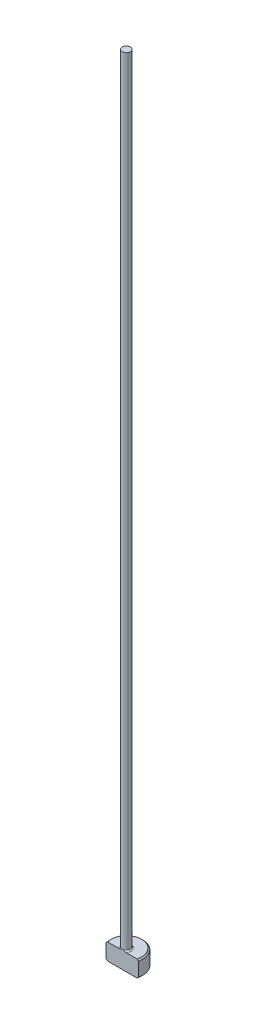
from build123d import *

# Parameters (mm, degrees)
CHAMFER1_SIZE = 0.254
FILLET1_R     = 0.254
KEY_DEPTH     = 153.466131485


with BuildPart() as part:
    # Sketch1 → Revolve1 (revolve)
    with BuildSketch(Plane.XY, mode=Mode.PRIVATE) as revolve1_sk:
        Polygon((0, 0), (-3.175, 0), (-3.175, 3.175), (-0.79375, 3.175), (-0.79375, 152.4), (0, 152.4), align=None)
    revolve(revolve1_sk.sketch.rotate(Axis((0, 259.958771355, 0), (0, -1, 0)), 270), axis=Axis((0, 259.958771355, 0), (0, -1, 0)))

    # Chamfer1
    chamfer1_edges = [part.edges().sort_by_distance(p)[0] for p in [
        (0, 3.175, -3.175),
        (0, 0, -3.175),
    ]]
    chamfer(chamfer1_edges, length=CHAMFER1_SIZE)

    # Fillet1
    fillet1_edges = [part.edges().sort_by_distance(p)[0] for p in [
        (0, 3.175, -0.79375),
    ]]
    fillet(fillet1_edges, radius=FILLET1_R)

    # Sketch2 → Key (cut, through all)
    with BuildSketch(Plane(origin=(0, 0, 0), x_dir=(1, 0, 0), z_dir=(0, 1, 0))):
        with BuildLine():
            Line((-3.074180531, -0.79375), (3.074180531, -0.79375))
            ThreePointArc((3.074180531, -0.79375), (0, -3.175), (-3.074180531, -0.79375))
        make_face()
    extrude(amount=KEY_DEPTH, mode=Mode.SUBTRACT)


solid = part.part
